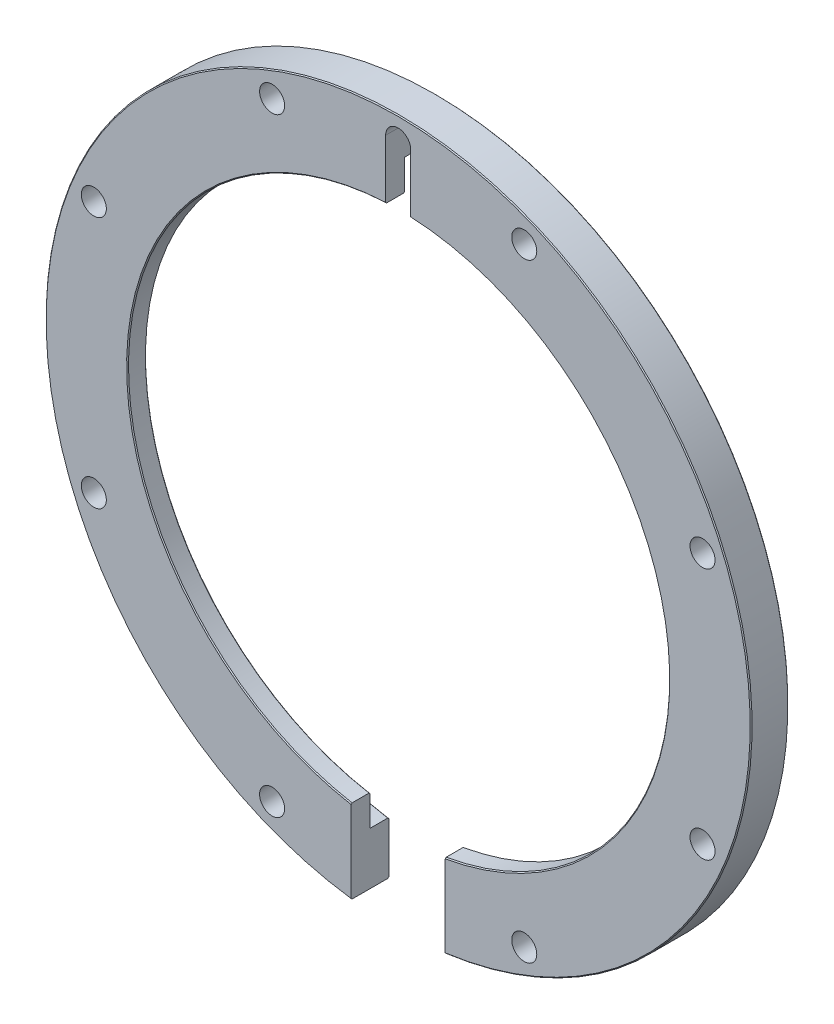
from build123d import *

# Parameters (mm, degrees)
SKETCH1_R            = 95.25
SKETCH1_R_2          = 81.28
BASE_RING_DEPTH      = 5.08
SKETCH2_R            = 95.25
SKETCH2_R_2          = 73.025
TAB_DEPTH            = 5.08
SKETCH3_R            = 3.3782
MOUNTING_HOLES_DEPTH = 284.096075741
SKETCH4_W            = 25.4
SKETCH4_H            = 30.292679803
GAP_DEPTH            = 284.096075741
CHAMFER1_SIZE        = 0.254
FLEX_CUT_DEPTH       = 283.486252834


with BuildPart() as part:
    # Sketch1 → base ring (new body)
    with BuildSketch(Plane.XY):
        with Locations((-101.6, -107.95)):
            Circle(SKETCH1_R)
        with Locations((-101.6, -107.95)):
            Circle(SKETCH1_R_2, mode=Mode.SUBTRACT)
    extrude(amount=BASE_RING_DEPTH)

    # Sketch2 → tab (add)
    with BuildSketch(Plane.XY.offset(5.08)):
        with Locations((-101.6, -107.95)):
            Circle(SKETCH2_R)
        with Locations((-101.6, -107.95)):
            Circle(SKETCH2_R_2, mode=Mode.SUBTRACT)
    extrude(amount=TAB_DEPTH)

    # Sketch3 → mounting holes (cut, through all)
    with BuildSketch(Plane.XY.offset(10.16)):
        with Locations((-67.579442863, -190.08289044)):
            Circle(SKETCH3_R)
        with Locations((-19.46710956, -141.970557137)):
            Circle(SKETCH3_R)
        with Locations((-19.46710956, -73.929442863)):
            Circle(SKETCH3_R)
        with Locations((-67.579442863, -25.81710956)):
            Circle(SKETCH3_R)
        with Locations((-135.620557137, -25.81710956)):
            Circle(SKETCH3_R)
        with Locations((-183.73289044, -73.929442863)):
            Circle(SKETCH3_R)
        with Locations((-135.620557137, -190.08289044)):
            Circle(SKETCH3_R)
        with Locations((-183.73289044, -141.970557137)):
            Circle(SKETCH3_R)
    extrude(amount=-MOUNTING_HOLES_DEPTH, mode=Mode.SUBTRACT)

    # Sketch4 → gap (cut, through all)
    with BuildSketch(Plane.XY.offset(10.16)):
        with Locations((-101.6, -195.008512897)):
            Rectangle(SKETCH4_W, SKETCH4_H)
    extrude(amount=-GAP_DEPTH, mode=Mode.SUBTRACT)

    # Chamfer1
    chamfer1_edges = [part.edges().sort_by_distance(p)[0] for p in [
        (-101.6, -34.925, 10.16),
        (-101.6, -34.925, 5.08),
        (-101.6, -12.7, 10.16),
        (-101.6, -26.67, 0),
        (-101.6, -12.7, 0),
    ]]
    chamfer(chamfer1_edges, length=CHAMFER1_SIZE)

    # Sketch5 → flex cut (cut, through all)
    with BuildSketch(Plane.XY.offset(10.16)):
        with BuildLine():
            Line((-104.9782, -19.05), (-104.9782, -35.003181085))
            ThreePointArc((-104.9782, -35.003181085), (-101.6, -34.925), (-98.2218, -35.003181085))
            Line((-98.2218, -35.003181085), (-98.2218, -19.05))
            ThreePointArc((-98.2218, -19.05), (-101.6, -15.6718), (-104.9782, -19.05))
        make_face()
    extrude(amount=-FLEX_CUT_DEPTH, mode=Mode.SUBTRACT)


solid = part.part
